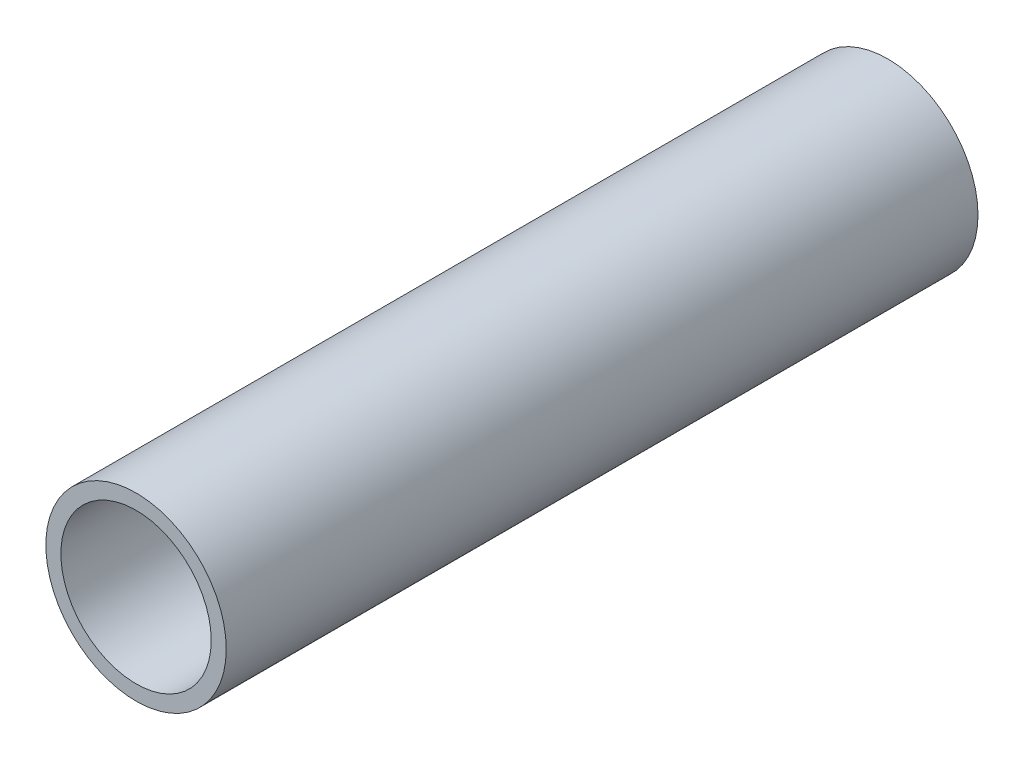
from build123d import *

# Parameters (mm, degrees)
ESQUISSE1_R      = 6
ESQUISSE1_R_2    = 5
EXTRUSION1_DEPTH = 25


with BuildPart() as part:
    # Esquisse1 → Extrusion1 (new, symmetric)
    with BuildSketch(Plane.XY):
        Circle(ESQUISSE1_R)
        Circle(ESQUISSE1_R_2, mode=Mode.SUBTRACT)
    extrude(amount=EXTRUSION1_DEPTH, both=True)


solid = part.part
